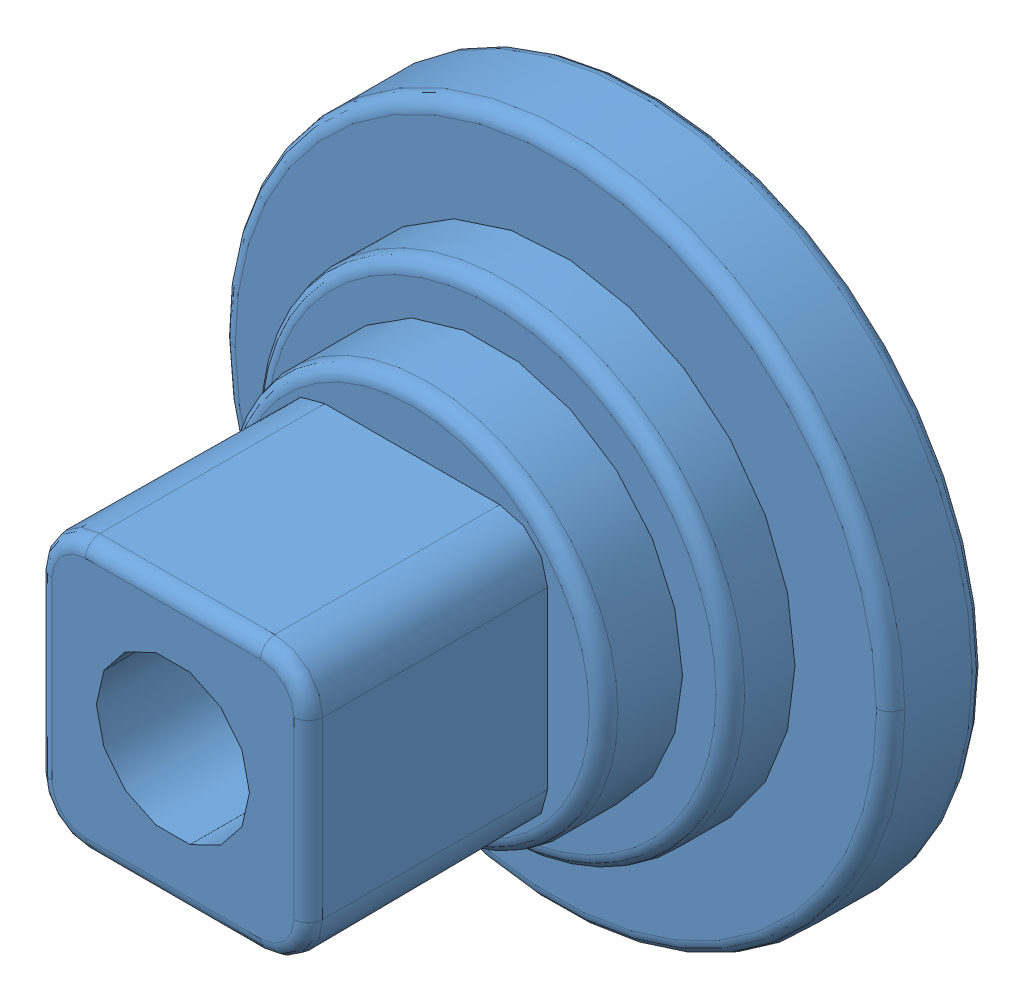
SolidWorks assembly M600 BASE_1-173.sldasm, configuration Default (file format 9000). Lengths in mm.
Overall size (14.04 14.04 10).
2 component instances, 2 part files, 0 mates.
Components (placement in the parent):
- D600 BASE_1-1731-1: D600 BASE_1-1731.sldprt [Default] at origin size (14.04 14.04 10)
- D600 BASE_1-1732-1: D600 BASE_1-1732.sldprt [Default] x (-1 0 0) z (0 1 0) size (5.5 4 5.5)
